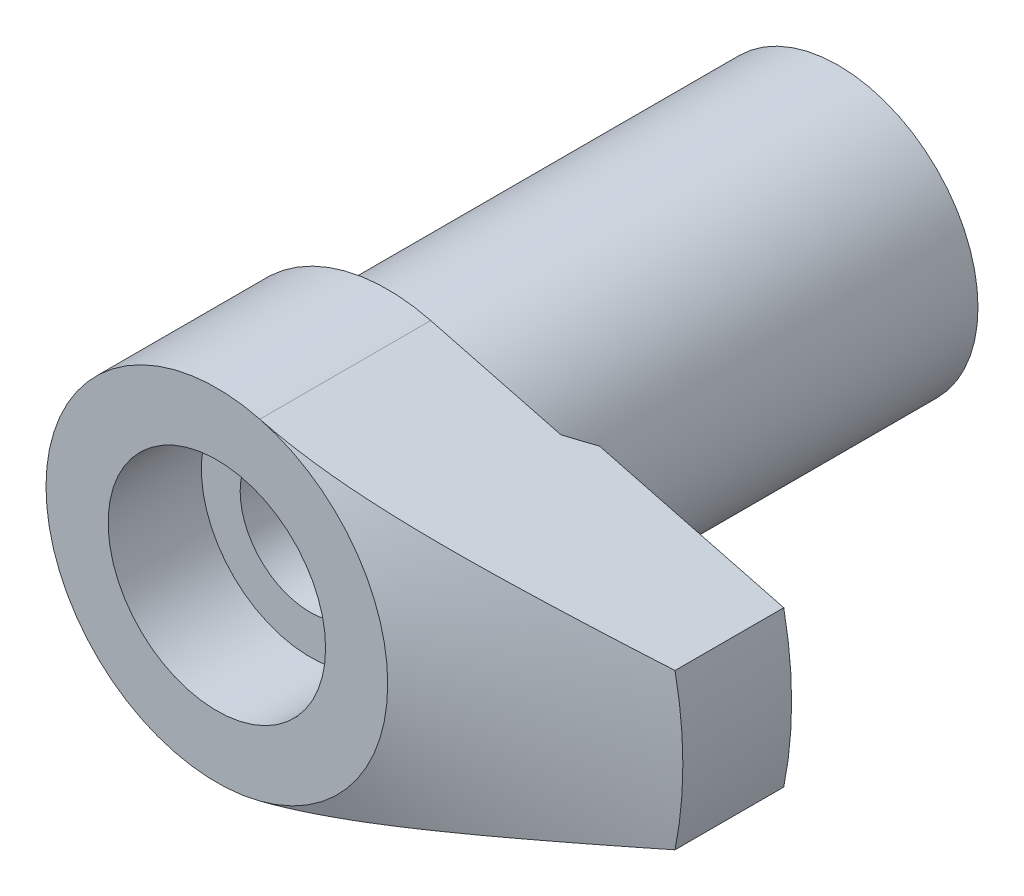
ISO-10303-21;
HEADER;
FILE_DESCRIPTION(('STEP AP214'),'2;1');
FILE_NAME('part.step','',(''),(''),'','','');
FILE_SCHEMA(('AUTOMOTIVE_DESIGN { 1 0 10303 214 1 1 1 1 }'));
ENDSEC;
DATA;
#1=APPLICATION_CONTEXT('core data for automotive mechanical design processes');
#2=APPLICATION_PROTOCOL_DEFINITION('international standard','automotive_design',2000,#1);
#3=PRODUCT_CONTEXT('',#1,'mechanical');
#4=PRODUCT('Part','Part','',(#3));
#5=PRODUCT_RELATED_PRODUCT_CATEGORY('part','',(#4));
#6=PRODUCT_DEFINITION_FORMATION('','',#4);
#7=PRODUCT_DEFINITION_CONTEXT('part definition',#1,'design');
#8=PRODUCT_DEFINITION('design','',#6,#7);
#9=PRODUCT_DEFINITION_SHAPE('','',#8);
#10=(LENGTH_UNIT() NAMED_UNIT(*) SI_UNIT(.MILLI.,.METRE.));
#11=(NAMED_UNIT(*) PLANE_ANGLE_UNIT() SI_UNIT($,.RADIAN.));
#12=(NAMED_UNIT(*) SI_UNIT($,.STERADIAN.) SOLID_ANGLE_UNIT());
#13=UNCERTAINTY_MEASURE_WITH_UNIT(LENGTH_MEASURE(1.E-05),#10,'distance_accuracy_value','');
#14=(GEOMETRIC_REPRESENTATION_CONTEXT(3) GLOBAL_UNCERTAINTY_ASSIGNED_CONTEXT((#13)) GLOBAL_UNIT_ASSIGNED_CONTEXT((#10,
#11,#12)) REPRESENTATION_CONTEXT('',''));
#15=CARTESIAN_POINT('',(0.,0.,0.));
#16=DIRECTION('',(0.,0.,1.));
#17=DIRECTION('',(1.,0.,0.));
#18=AXIS2_PLACEMENT_3D('',#15,#16,#17);
#19=CARTESIAN_POINT('',(24.4948974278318,5.,40.));
#20=DIRECTION('',(-0.25151064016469,-0.967854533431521,0.));
#21=DIRECTION('',(0.967854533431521,-0.25151064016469,0.));
#22=AXIS2_PLACEMENT_3D('',#19,#20,#21);
#23=PLANE('',#22);
#24=DIRECTION('',(0.967854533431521,-0.251510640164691,0.));
#25=VECTOR('',#24,1.);
#26=CARTESIAN_POINT('',(2.76661704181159,10.6463998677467,29.));
#27=LINE('',#26,#25);
#28=CARTESIAN_POINT('',(2.76661704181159,10.6463998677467,29.));
#29=VERTEX_POINT('',#28);
#30=CARTESIAN_POINT('',(11.1484831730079,8.46825383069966,29.));
#31=VERTEX_POINT('',#30);
#32=EDGE_CURVE('E76',#29,#31,#27,.T.);
#33=ORIENTED_EDGE('',*,*,#32,.F.);
#34=DIRECTION('',(0.,0.,-1.));
#35=VECTOR('',#34,1.);
#36=CARTESIAN_POINT('',(2.76661704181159,10.6463998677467,40.));
#37=LINE('',#36,#35);
#38=CARTESIAN_POINT('',(2.76661704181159,10.6463998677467,40.));
#39=VERTEX_POINT('',#38);
#40=EDGE_CURVE('E80',#39,#29,#37,.T.);
#41=ORIENTED_EDGE('',*,*,#40,.F.);
#42=CARTESIAN_POINT('',(24.4950974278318,4.99994802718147,34.9999337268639));
#43=CARTESIAN_POINT('',(24.0522116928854,5.11503812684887,35.1466796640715));
#44=CARTESIAN_POINT('',(23.6090863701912,5.23019048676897,35.2926581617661));
#45=CARTESIAN_POINT('',(22.7222658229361,5.46064330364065,35.5827713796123));
#46=CARTESIAN_POINT('',(22.2785705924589,5.57594376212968,35.7269060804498));
#47=CARTESIAN_POINT('',(21.3906147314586,5.80669160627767,36.0129920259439));
#48=CARTESIAN_POINT('',(20.9463542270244,5.92213895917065,36.1549436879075));
#49=CARTESIAN_POINT('',(20.0570760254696,6.15323043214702,36.4362914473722));
#50=CARTESIAN_POINT('',(19.6120583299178,6.26887455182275,36.5756875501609));
#51=CARTESIAN_POINT('',(18.7232977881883,6.49983150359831,36.8507651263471));
#52=CARTESIAN_POINT('',(18.2795592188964,6.6151432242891,36.9864613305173));
#53=CARTESIAN_POINT('',(17.3910601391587,6.84603223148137,37.2542320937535));
#54=CARTESIAN_POINT('',(16.94629963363,6.96160951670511,37.3863066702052));
#55=CARTESIAN_POINT('',(16.0554166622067,7.1931180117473,37.6461271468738));
#56=CARTESIAN_POINT('',(15.6092937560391,7.30904933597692,37.7738714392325));
#57=CARTESIAN_POINT('',(14.7156449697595,7.54127656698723,38.0240315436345));
#58=CARTESIAN_POINT('',(14.2681190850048,7.65757247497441,38.1464473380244));
#59=CARTESIAN_POINT('',(13.3686258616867,7.89131846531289,38.3855064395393));
#60=CARTESIAN_POINT('',(12.9166482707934,8.0087712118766,38.5021087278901));
#61=CARTESIAN_POINT('',(12.0107954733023,8.2441698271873,38.7271951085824));
#62=CARTESIAN_POINT('',(11.5569202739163,8.3621156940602,38.8356792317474));
#63=CARTESIAN_POINT('',(10.6474365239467,8.59845786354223,39.0425667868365));
#64=CARTESIAN_POINT('',(10.1918298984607,8.71685366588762,39.1409791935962));
#65=CARTESIAN_POINT('',(9.27826891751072,8.954255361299,39.3255960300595));
#66=CARTESIAN_POINT('',(8.82031448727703,9.07326127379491,39.4118000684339));
#67=CARTESIAN_POINT('',(7.8996808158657,9.31250090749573,39.5698254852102));
#68=CARTESIAN_POINT('',(7.43698939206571,9.43273779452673,39.641571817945));
#69=CARTESIAN_POINT('',(6.50937566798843,9.67379129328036,39.7673452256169));
#70=CARTESIAN_POINT('',(6.04445370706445,9.79460781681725,39.8213749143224));
#71=CARTESIAN_POINT('',(5.34500310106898,9.97636991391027,39.8872915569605));
#72=CARTESIAN_POINT('',(5.11113046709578,10.0371450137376,39.9067615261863));
#73=CARTESIAN_POINT('',(4.6430233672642,10.1587892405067,39.9403487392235));
#74=CARTESIAN_POINT('',(4.40878890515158,10.2196583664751,39.9544660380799));
#75=CARTESIAN_POINT('',(3.93993571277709,10.341496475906,39.9771441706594));
#76=CARTESIAN_POINT('',(3.70531684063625,10.4024654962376,39.9857018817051));
#77=CARTESIAN_POINT('',(3.23593856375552,10.5244400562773,39.997138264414));
#78=CARTESIAN_POINT('',(3.00117915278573,10.5854455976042,40.000016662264));
#79=CARTESIAN_POINT('',(2.7664170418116,10.6464518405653,39.9999999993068));
#80=B_SPLINE_CURVE_WITH_KNOTS('',3,(#42,#43,#44,#45,#46,#47,#48,#49,#50,#51,#52,#53,#54,#55,#56,
#57,#58,#59,#60,#61,#62,#63,#64,#65,#66,#67,#68,#69,#70,#71,#72,#73,#74,#75,#76,#77,#78,#79),
.UNSPECIFIED.,.F.,.F.,(4,2,2,2,2,2,2,2,2,2,2,2,2,2,2,2,2,2,4),(0.,1.44165002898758,
2.88331514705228,4.32470116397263,5.76608419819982,7.20048032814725,8.6348695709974,
10.0697857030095,11.5047065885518,12.9486269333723,14.3925417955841,15.8351585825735,
17.277821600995,18.7277903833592,20.1775451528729,20.9047655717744,21.631978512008,
22.3595995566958,23.0872556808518),.UNSPECIFIED.);
#81=CARTESIAN_POINT('',(24.4948974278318,5.,35.));
#82=VERTEX_POINT('',#81);
#83=EDGE_CURVE('E143',#82,#39,#80,.T.);
#84=ORIENTED_EDGE('',*,*,#83,.F.);
#85=DIRECTION('',(0.,0.,-1.));
#86=VECTOR('',#85,1.);
#87=CARTESIAN_POINT('',(24.4948974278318,5.,40.));
#88=LINE('',#87,#86);
#89=CARTESIAN_POINT('',(24.4948974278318,5.,28.));
#90=VERTEX_POINT('',#89);
#91=EDGE_CURVE('E99',#82,#90,#88,.T.);
#92=ORIENTED_EDGE('',*,*,#91,.T.);
#93=DIRECTION('',(-0.967854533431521,0.25151064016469,0.));
#94=VECTOR('',#93,1.);
#95=CARTESIAN_POINT('',(24.4948974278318,5.,28.));
#96=LINE('',#95,#94);
#97=CARTESIAN_POINT('',(12.6368353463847,8.0814845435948,28.));
#98=VERTEX_POINT('',#97);
#99=EDGE_CURVE('E198',#90,#98,#96,.T.);
#100=ORIENTED_EDGE('',*,*,#99,.T.);
#101=CARTESIAN_POINT('',(26.2382325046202,4.54696981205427,16.3706969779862));
#102=CARTESIAN_POINT('',(25.8991823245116,4.63507677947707,16.6897147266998));
#103=CARTESIAN_POINT('',(25.5595716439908,4.72332940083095,17.0080978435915));
#104=CARTESIAN_POINT('',(24.8790691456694,4.90016756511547,17.6434048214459));
#105=CARTESIAN_POINT('',(24.5381773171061,4.98875311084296,17.9603286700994));
#106=CARTESIAN_POINT('',(23.8548820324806,5.16631702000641,18.5925921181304));
#107=CARTESIAN_POINT('',(23.5124782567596,5.25529546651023,18.9079313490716));
#108=CARTESIAN_POINT('',(22.8260407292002,5.43367593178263,19.5367066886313));
#109=CARTESIAN_POINT('',(22.4820069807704,5.52307794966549,19.8501428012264));
#110=CARTESIAN_POINT('',(21.443461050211,5.79295874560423,20.790528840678));
#111=CARTESIAN_POINT('',(20.7461385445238,5.97416782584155,21.4141836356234));
#112=CARTESIAN_POINT('',(19.6928188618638,6.24788778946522,22.3406851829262));
#113=CARTESIAN_POINT('',(19.3405068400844,6.33944103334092,22.6480076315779));
#114=CARTESIAN_POINT('',(18.6330196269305,6.52329155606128,23.2591176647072));
#115=CARTESIAN_POINT('',(18.2778444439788,6.61558883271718,23.562905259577));
#116=CARTESIAN_POINT('',(17.6243853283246,6.78539939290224,24.1153607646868));
#117=CARTESIAN_POINT('',(17.3266162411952,6.86277888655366,24.3646784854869));
#118=CARTESIAN_POINT('',(16.7284511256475,7.01822052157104,24.859925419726));
#119=CARTESIAN_POINT('',(16.428055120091,7.09628265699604,25.1058546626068));
#120=CARTESIAN_POINT('',(15.8241820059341,7.25320759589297,25.5937959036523));
#121=CARTESIAN_POINT('',(15.5207042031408,7.3320705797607,25.8358069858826));
#122=CARTESIAN_POINT('',(14.910279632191,7.49069800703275,26.3151273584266));
#123=CARTESIAN_POINT('',(14.6033328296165,7.57046245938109,26.5524366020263));
#124=CARTESIAN_POINT('',(13.985611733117,7.73098599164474,27.0213074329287));
#125=CARTESIAN_POINT('',(13.6748396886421,7.81174448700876,27.2528721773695));
#126=CARTESIAN_POINT('',(13.0486773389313,7.97446159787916,27.709237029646));
#127=CARTESIAN_POINT('',(12.7332871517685,8.05642018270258,27.9340373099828));
#128=CARTESIAN_POINT('',(12.0972918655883,8.22169252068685,28.3753142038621));
#129=CARTESIAN_POINT('',(11.7766892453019,8.30500562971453,28.5917946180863));
#130=CARTESIAN_POINT('',(11.129246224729,8.47325282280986,29.0146878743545));
#131=CARTESIAN_POINT('',(10.8024050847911,8.55818709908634,29.2210995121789));
#132=CARTESIAN_POINT('',(10.117911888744,8.73606230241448,29.6357554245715));
#133=CARTESIAN_POINT('',(9.75972979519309,8.82914096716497,29.8430719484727));
#134=CARTESIAN_POINT('',(9.03406791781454,9.01771443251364,30.2394227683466));
#135=CARTESIAN_POINT('',(8.66659090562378,9.11320851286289,30.4284624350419));
#136=CARTESIAN_POINT('',(7.92165369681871,9.30679094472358,30.7831080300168));
#137=CARTESIAN_POINT('',(7.54420676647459,9.40487584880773,30.9487434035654));
#138=CARTESIAN_POINT('',(6.77840319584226,9.60388069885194,31.2506267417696));
#139=CARTESIAN_POINT('',(6.39005017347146,9.70479970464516,31.3868843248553));
#140=CARTESIAN_POINT('',(5.68950520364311,9.88684618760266,31.5970144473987));
#141=CARTESIAN_POINT('',(5.37932687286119,9.96745039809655,31.6780161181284));
#142=CARTESIAN_POINT('',(4.75371765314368,10.1300237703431,31.814494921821));
#143=CARTESIAN_POINT('',(4.43828751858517,10.2119927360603,31.8699756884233));
#144=CARTESIAN_POINT('',(3.8050254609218,10.376554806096,31.952547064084));
#145=CARTESIAN_POINT('',(3.48720563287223,10.4591447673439,31.9797352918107));
#146=CARTESIAN_POINT('',(2.85047359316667,10.6246085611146,32.0045695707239));
#147=CARTESIAN_POINT('',(2.53156140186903,10.7074823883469,32.0022161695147));
#148=CARTESIAN_POINT('',(1.89635384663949,10.8725500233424,31.9681621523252));
#149=CARTESIAN_POINT('',(1.58005322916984,10.9547451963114,31.9365643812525));
#150=CARTESIAN_POINT('',(0.951191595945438,11.118163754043,31.8458635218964));
#151=CARTESIAN_POINT('',(0.638630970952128,11.1993870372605,31.7867575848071));
#152=CARTESIAN_POINT('',(0.0158552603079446,11.3612240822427,31.6431401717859));
#153=CARTESIAN_POINT('',(-0.294306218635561,11.4418239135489,31.5583836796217));
#154=CARTESIAN_POINT('',(-0.90815448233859,11.6013410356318,31.3670987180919));
#155=CARTESIAN_POINT('',(-1.211842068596,11.6802585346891,31.2605729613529));
#156=CARTESIAN_POINT('',(-1.85174828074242,11.8465471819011,31.0140240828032));
#157=CARTESIAN_POINT('',(-2.18703716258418,11.9336767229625,30.8714433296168));
#158=CARTESIAN_POINT('',(-2.84944117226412,12.1058117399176,30.5671414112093));
#159=CARTESIAN_POINT('',(-3.17655313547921,12.1908163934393,30.4054129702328));
#160=CARTESIAN_POINT('',(-3.82402043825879,12.3590698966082,30.0660746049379));
#161=CARTESIAN_POINT('',(-4.14435525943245,12.4423134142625,29.8884231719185));
#162=CARTESIAN_POINT('',(-4.77813236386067,12.6070093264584,29.5206130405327));
#163=CARTESIAN_POINT('',(-5.09157553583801,12.6884619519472,29.3304559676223));
#164=CARTESIAN_POINT('',(-5.70078766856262,12.84677431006,28.9472912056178));
#165=CARTESIAN_POINT('',(-5.99677846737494,12.9236916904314,28.7546583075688));
#166=CARTESIAN_POINT('',(-6.58388700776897,13.0762601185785,28.3615982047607));
#167=CARTESIAN_POINT('',(-6.8750044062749,13.151911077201,28.1611704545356));
#168=CARTESIAN_POINT('',(-7.45101169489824,13.3015946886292,27.7552342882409));
#169=CARTESIAN_POINT('',(-7.73593036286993,13.3756348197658,27.5497693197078));
#170=CARTESIAN_POINT('',(-8.30199242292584,13.522734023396,27.1335064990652));
#171=CARTESIAN_POINT('',(-8.58313673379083,13.5957933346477,26.9227099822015));
#172=CARTESIAN_POINT('',(-8.86268598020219,13.6684381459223,26.7097144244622));
#173=B_SPLINE_CURVE_WITH_KNOTS('',3,(#101,#102,#103,#104,#105,#106,#107,#108,#109,#110,#111,
#112,#113,#114,#115,#116,#117,#118,#119,#120,#121,#122,#123,#124,#125,#126,#127,#128,#129,#130,
#131,#132,#133,#134,#135,#136,#137,#138,#139,#140,#141,#142,#143,#144,#145,#146,#147,#148,#149,
#150,#151,#152,#153,#154,#155,#156,#157,#158,#159,#160,#161,#162,#163,#164,#165,#166,#167,#168,
#169,#170,#171,#172),.UNSPECIFIED.,.F.,.F.,(4,2,2,2,2,2,2,2,2,2,2,2,2,2,2,2,2,2,2,2,2,2,2,2,2,2,
2,2,2,2,2,2,2,2,2,4),(0.,1.42141224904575,2.8428364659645,4.26457715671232,5.68631487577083,
8.54493189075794,9.9741023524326,11.4032686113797,12.5912386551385,13.7791983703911,
14.9674318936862,16.1556772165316,17.3432543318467,18.5308011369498,19.7177988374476,
20.9049381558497,22.1771102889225,23.448907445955,24.7190900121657,25.9888560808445,
26.9796391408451,27.9702810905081,28.9574935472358,29.9446877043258,30.9284232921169,
31.9122607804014,32.9058096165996,33.8992347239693,35.022369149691,36.1459317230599,
37.2725135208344,38.3989491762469,39.483111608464,40.5673500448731,41.6442669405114,
42.7209167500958),.UNSPECIFIED.);
#174=EDGE_CURVE('E83',#98,#31,#173,.T.);
#175=ORIENTED_EDGE('',*,*,#174,.T.);
#176=EDGE_LOOP('',(#33,#41,#84,#92,#100,#175));
#177=FACE_BOUND('',#176,.T.);
#178=ADVANCED_FACE('F15',(#177),#23,.F.);
#179=CARTESIAN_POINT('',(24.4948974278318,-5.,40.));
#180=DIRECTION('',(0.25151064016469,-0.967854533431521,0.));
#181=DIRECTION('',(0.967854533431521,0.25151064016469,0.));
#182=AXIS2_PLACEMENT_3D('',#179,#180,#181);
#183=PLANE('',#182);
#184=DIRECTION('',(0.,0.,-1.));
#185=VECTOR('',#184,1.);
#186=CARTESIAN_POINT('',(2.76661704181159,-10.6463998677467,40.));
#187=LINE('',#186,#185);
#188=CARTESIAN_POINT('',(2.76661704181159,-10.6463998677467,40.));
#189=VERTEX_POINT('',#188);
#190=CARTESIAN_POINT('',(2.76661704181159,-10.6463998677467,29.));
#191=VERTEX_POINT('',#190);
#192=EDGE_CURVE('E100',#189,#191,#187,.T.);
#193=ORIENTED_EDGE('',*,*,#192,.T.);
#194=DIRECTION('',(-0.967854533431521,-0.251510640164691,0.));
#195=VECTOR('',#194,1.);
#196=CARTESIAN_POINT('',(11.1484831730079,-8.46825383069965,29.));
#197=LINE('',#196,#195);
#198=CARTESIAN_POINT('',(11.1484831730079,-8.46825383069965,29.));
#199=VERTEX_POINT('',#198);
#200=EDGE_CURVE('E86',#199,#191,#197,.T.);
#201=ORIENTED_EDGE('',*,*,#200,.F.);
#202=CARTESIAN_POINT('',(26.2382325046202,-4.54696981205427,16.3706969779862));
#203=CARTESIAN_POINT('',(25.8991823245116,-4.63507677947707,16.6897147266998));
#204=CARTESIAN_POINT('',(25.5595716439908,-4.72332940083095,17.0080978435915));
#205=CARTESIAN_POINT('',(24.8790691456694,-4.90016756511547,17.6434048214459));
#206=CARTESIAN_POINT('',(24.5381773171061,-4.98875311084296,17.9603286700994));
#207=CARTESIAN_POINT('',(23.8548820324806,-5.16631702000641,18.5925921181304));
#208=CARTESIAN_POINT('',(23.5124782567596,-5.25529546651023,18.9079313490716));
#209=CARTESIAN_POINT('',(22.8260407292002,-5.43367593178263,19.5367066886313));
#210=CARTESIAN_POINT('',(22.4820069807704,-5.52307794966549,19.8501428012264));
#211=CARTESIAN_POINT('',(21.443461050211,-5.79295874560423,20.790528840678));
#212=CARTESIAN_POINT('',(20.7461385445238,-5.97416782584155,21.4141836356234));
#213=CARTESIAN_POINT('',(19.6928188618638,-6.24788778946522,22.3406851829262));
#214=CARTESIAN_POINT('',(19.3405068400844,-6.33944103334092,22.6480076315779));
#215=CARTESIAN_POINT('',(18.6330196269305,-6.52329155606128,23.2591176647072));
#216=CARTESIAN_POINT('',(18.2778444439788,-6.61558883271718,23.562905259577));
#217=CARTESIAN_POINT('',(17.6243853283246,-6.78539939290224,24.1153607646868));
#218=CARTESIAN_POINT('',(17.3266162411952,-6.86277888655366,24.3646784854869));
#219=CARTESIAN_POINT('',(16.7284511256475,-7.01822052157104,24.859925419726));
#220=CARTESIAN_POINT('',(16.428055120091,-7.09628265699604,25.1058546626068));
#221=CARTESIAN_POINT('',(15.8241820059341,-7.25320759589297,25.5937959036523));
#222=CARTESIAN_POINT('',(15.5207042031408,-7.3320705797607,25.8358069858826));
#223=CARTESIAN_POINT('',(14.910279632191,-7.49069800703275,26.3151273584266));
#224=CARTESIAN_POINT('',(14.6033328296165,-7.57046245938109,26.5524366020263));
#225=CARTESIAN_POINT('',(13.985611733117,-7.73098599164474,27.0213074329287));
#226=CARTESIAN_POINT('',(13.6748396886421,-7.81174448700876,27.2528721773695));
#227=CARTESIAN_POINT('',(13.0486773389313,-7.97446159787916,27.709237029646));
#228=CARTESIAN_POINT('',(12.7332871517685,-8.05642018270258,27.9340373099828));
#229=CARTESIAN_POINT('',(12.0972918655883,-8.22169252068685,28.3753142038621));
#230=CARTESIAN_POINT('',(11.7766892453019,-8.30500562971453,28.5917946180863));
#231=CARTESIAN_POINT('',(11.129246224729,-8.47325282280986,29.0146878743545));
#232=CARTESIAN_POINT('',(10.8024050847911,-8.55818709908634,29.2210995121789));
#233=CARTESIAN_POINT('',(10.117911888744,-8.73606230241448,29.6357554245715));
#234=CARTESIAN_POINT('',(9.75972979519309,-8.82914096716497,29.8430719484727));
#235=CARTESIAN_POINT('',(9.03406791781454,-9.01771443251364,30.2394227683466));
#236=CARTESIAN_POINT('',(8.66659090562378,-9.11320851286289,30.4284624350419));
#237=CARTESIAN_POINT('',(7.92165369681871,-9.30679094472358,30.7831080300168));
#238=CARTESIAN_POINT('',(7.54420676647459,-9.40487584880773,30.9487434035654));
#239=CARTESIAN_POINT('',(6.77840319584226,-9.60388069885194,31.2506267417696));
#240=CARTESIAN_POINT('',(6.39005017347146,-9.70479970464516,31.3868843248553));
#241=CARTESIAN_POINT('',(5.68950520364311,-9.88684618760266,31.5970144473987));
#242=CARTESIAN_POINT('',(5.37932687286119,-9.96745039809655,31.6780161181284));
#243=CARTESIAN_POINT('',(4.75371765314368,-10.1300237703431,31.814494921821));
#244=CARTESIAN_POINT('',(4.43828751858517,-10.2119927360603,31.8699756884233));
#245=CARTESIAN_POINT('',(3.8050254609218,-10.376554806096,31.952547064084));
#246=CARTESIAN_POINT('',(3.48720563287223,-10.4591447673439,31.9797352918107));
#247=CARTESIAN_POINT('',(2.85047359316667,-10.6246085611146,32.0045695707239));
#248=CARTESIAN_POINT('',(2.53156140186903,-10.7074823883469,32.0022161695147));
#249=CARTESIAN_POINT('',(1.89635384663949,-10.8725500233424,31.9681621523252));
#250=CARTESIAN_POINT('',(1.58005322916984,-10.9547451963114,31.9365643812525));
#251=CARTESIAN_POINT('',(0.951191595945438,-11.118163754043,31.8458635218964));
#252=CARTESIAN_POINT('',(0.638630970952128,-11.1993870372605,31.7867575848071));
#253=CARTESIAN_POINT('',(0.0158552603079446,-11.3612240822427,31.6431401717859));
#254=CARTESIAN_POINT('',(-0.294306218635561,-11.4418239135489,31.5583836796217));
#255=CARTESIAN_POINT('',(-0.90815448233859,-11.6013410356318,31.3670987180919));
#256=CARTESIAN_POINT('',(-1.211842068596,-11.6802585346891,31.2605729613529));
#257=CARTESIAN_POINT('',(-1.85174828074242,-11.8465471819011,31.0140240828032));
#258=CARTESIAN_POINT('',(-2.18703716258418,-11.9336767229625,30.8714433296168));
#259=CARTESIAN_POINT('',(-2.84944117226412,-12.1058117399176,30.5671414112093));
#260=CARTESIAN_POINT('',(-3.17655313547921,-12.1908163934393,30.4054129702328));
#261=CARTESIAN_POINT('',(-3.82402043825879,-12.3590698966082,30.0660746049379));
#262=CARTESIAN_POINT('',(-4.14435525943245,-12.4423134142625,29.8884231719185));
#263=CARTESIAN_POINT('',(-4.77813236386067,-12.6070093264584,29.5206130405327));
#264=CARTESIAN_POINT('',(-5.09157553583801,-12.6884619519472,29.3304559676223));
#265=CARTESIAN_POINT('',(-5.70078766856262,-12.84677431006,28.9472912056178));
#266=CARTESIAN_POINT('',(-5.99677846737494,-12.9236916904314,28.7546583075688));
#267=CARTESIAN_POINT('',(-6.58388700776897,-13.0762601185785,28.3615982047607));
#268=CARTESIAN_POINT('',(-6.8750044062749,-13.151911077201,28.1611704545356));
#269=CARTESIAN_POINT('',(-7.45101169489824,-13.3015946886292,27.7552342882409));
#270=CARTESIAN_POINT('',(-7.73593036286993,-13.3756348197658,27.5497693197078));
#271=CARTESIAN_POINT('',(-8.30199242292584,-13.522734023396,27.1335064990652));
#272=CARTESIAN_POINT('',(-8.58313673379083,-13.5957933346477,26.9227099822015));
#273=CARTESIAN_POINT('',(-8.86268598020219,-13.6684381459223,26.7097144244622));
#274=B_SPLINE_CURVE_WITH_KNOTS('',3,(#202,#203,#204,#205,#206,#207,#208,#209,#210,#211,#212,
#213,#214,#215,#216,#217,#218,#219,#220,#221,#222,#223,#224,#225,#226,#227,#228,#229,#230,#231,
#232,#233,#234,#235,#236,#237,#238,#239,#240,#241,#242,#243,#244,#245,#246,#247,#248,#249,#250,
#251,#252,#253,#254,#255,#256,#257,#258,#259,#260,#261,#262,#263,#264,#265,#266,#267,#268,#269,
#270,#271,#272,#273),.UNSPECIFIED.,.F.,.F.,(4,2,2,2,2,2,2,2,2,2,2,2,2,2,2,2,2,2,2,2,2,2,2,2,2,2,
2,2,2,2,2,2,2,2,2,4),(0.,1.42141224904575,2.8428364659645,4.26457715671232,5.68631487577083,
8.54493189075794,9.9741023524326,11.4032686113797,12.5912386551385,13.7791983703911,
14.9674318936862,16.1556772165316,17.3432543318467,18.5308011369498,19.7177988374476,
20.9049381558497,22.1771102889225,23.448907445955,24.7190900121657,25.9888560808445,
26.9796391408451,27.9702810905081,28.9574935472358,29.9446877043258,30.9284232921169,
31.9122607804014,32.9058096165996,33.8992347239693,35.022369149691,36.1459317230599,
37.2725135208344,38.3989491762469,39.483111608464,40.5673500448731,41.6442669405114,
42.7209167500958),.UNSPECIFIED.);
#275=CARTESIAN_POINT('',(12.6368353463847,-8.0814845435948,28.));
#276=VERTEX_POINT('',#275);
#277=EDGE_CURVE('E9',#276,#199,#274,.T.);
#278=ORIENTED_EDGE('',*,*,#277,.F.);
#279=DIRECTION('',(-0.967854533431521,-0.25151064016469,0.));
#280=VECTOR('',#279,1.);
#281=CARTESIAN_POINT('',(24.4948974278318,-5.,28.));
#282=LINE('',#281,#280);
#283=CARTESIAN_POINT('',(24.4948974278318,-5.,28.));
#284=VERTEX_POINT('',#283);
#285=EDGE_CURVE('E29',#284,#276,#282,.T.);
#286=ORIENTED_EDGE('',*,*,#285,.F.);
#287=DIRECTION('',(0.,0.,-1.));
#288=VECTOR('',#287,1.);
#289=CARTESIAN_POINT('',(24.4948974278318,-5.,40.));
#290=LINE('',#289,#288);
#291=CARTESIAN_POINT('',(24.4948974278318,-5.,35.));
#292=VERTEX_POINT('',#291);
#293=EDGE_CURVE('E43',#292,#284,#290,.T.);
#294=ORIENTED_EDGE('',*,*,#293,.F.);
#295=CARTESIAN_POINT('',(24.4950974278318,-4.99994802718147,34.9999337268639));
#296=CARTESIAN_POINT('',(24.0522116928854,-5.11503812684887,35.1466796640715));
#297=CARTESIAN_POINT('',(23.6090863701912,-5.23019048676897,35.2926581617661));
#298=CARTESIAN_POINT('',(22.7222658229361,-5.46064330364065,35.5827713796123));
#299=CARTESIAN_POINT('',(22.2785705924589,-5.57594376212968,35.7269060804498));
#300=CARTESIAN_POINT('',(21.3906147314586,-5.80669160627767,36.0129920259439));
#301=CARTESIAN_POINT('',(20.9463542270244,-5.92213895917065,36.1549436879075));
#302=CARTESIAN_POINT('',(20.0570760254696,-6.15323043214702,36.4362914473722));
#303=CARTESIAN_POINT('',(19.6120583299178,-6.26887455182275,36.5756875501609));
#304=CARTESIAN_POINT('',(18.7232977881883,-6.49983150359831,36.8507651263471));
#305=CARTESIAN_POINT('',(18.2795592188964,-6.6151432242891,36.9864613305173));
#306=CARTESIAN_POINT('',(17.3910601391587,-6.84603223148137,37.2542320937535));
#307=CARTESIAN_POINT('',(16.94629963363,-6.96160951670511,37.3863066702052));
#308=CARTESIAN_POINT('',(16.0554166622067,-7.1931180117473,37.6461271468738));
#309=CARTESIAN_POINT('',(15.6092937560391,-7.30904933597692,37.7738714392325));
#310=CARTESIAN_POINT('',(14.7156449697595,-7.54127656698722,38.0240315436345));
#311=CARTESIAN_POINT('',(14.2681190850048,-7.65757247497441,38.1464473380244));
#312=CARTESIAN_POINT('',(13.3686258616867,-7.89131846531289,38.3855064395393));
#313=CARTESIAN_POINT('',(12.9166482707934,-8.0087712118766,38.5021087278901));
#314=CARTESIAN_POINT('',(12.0107954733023,-8.2441698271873,38.7271951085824));
#315=CARTESIAN_POINT('',(11.5569202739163,-8.36211569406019,38.8356792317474));
#316=CARTESIAN_POINT('',(10.6474365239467,-8.59845786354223,39.0425667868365));
#317=CARTESIAN_POINT('',(10.1918298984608,-8.71685366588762,39.1409791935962));
#318=CARTESIAN_POINT('',(9.27826891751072,-8.95425536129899,39.3255960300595));
#319=CARTESIAN_POINT('',(8.82031448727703,-9.07326127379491,39.4118000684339));
#320=CARTESIAN_POINT('',(7.8996808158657,-9.31250090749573,39.5698254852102));
#321=CARTESIAN_POINT('',(7.43698939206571,-9.43273779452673,39.641571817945));
#322=CARTESIAN_POINT('',(6.50937566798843,-9.67379129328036,39.7673452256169));
#323=CARTESIAN_POINT('',(6.04445370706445,-9.79460781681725,39.8213749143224));
#324=CARTESIAN_POINT('',(5.34500310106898,-9.97636991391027,39.8872915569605));
#325=CARTESIAN_POINT('',(5.11113046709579,-10.0371450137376,39.9067615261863));
#326=CARTESIAN_POINT('',(4.6430233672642,-10.1587892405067,39.9403487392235));
#327=CARTESIAN_POINT('',(4.40878890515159,-10.2196583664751,39.9544660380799));
#328=CARTESIAN_POINT('',(3.9399357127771,-10.341496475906,39.9771441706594));
#329=CARTESIAN_POINT('',(3.70531684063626,-10.4024654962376,39.9857018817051));
#330=CARTESIAN_POINT('',(3.23593856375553,-10.5244400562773,39.997138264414));
#331=CARTESIAN_POINT('',(3.00117915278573,-10.5854455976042,40.000016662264));
#332=CARTESIAN_POINT('',(2.7664170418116,-10.6464518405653,39.9999999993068));
#333=B_SPLINE_CURVE_WITH_KNOTS('',3,(#295,#296,#297,#298,#299,#300,#301,#302,#303,#304,#305,
#306,#307,#308,#309,#310,#311,#312,#313,#314,#315,#316,#317,#318,#319,#320,#321,#322,#323,#324,
#325,#326,#327,#328,#329,#330,#331,#332),.UNSPECIFIED.,.F.,.F.,(4,2,2,2,2,2,2,2,2,2,2,2,2,2,2,2,
2,2,4),(0.,1.44165002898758,2.88331514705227,4.32470116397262,5.76608419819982,7.20048032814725,
8.6348695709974,10.0697857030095,11.5047065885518,12.9486269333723,14.3925417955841,
15.8351585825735,17.277821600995,18.7277903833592,20.1775451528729,20.9047655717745,
21.631978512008,22.3595995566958,23.0872556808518),.UNSPECIFIED.);
#334=EDGE_CURVE('E135',#292,#189,#333,.T.);
#335=ORIENTED_EDGE('',*,*,#334,.T.);
#336=EDGE_LOOP('',(#193,#201,#278,#286,#294,#335));
#337=FACE_BOUND('',#336,.T.);
#338=ADVANCED_FACE('F149',(#337),#183,.T.);
#339=CARTESIAN_POINT('',(0.,0.,40.));
#340=DIRECTION('',(0.,0.,-1.));
#341=DIRECTION('',(-1.,0.,0.));
#342=AXIS2_PLACEMENT_3D('',#339,#340,#341);
#343=CYLINDRICAL_SURFACE('',#342,11.);
#344=CARTESIAN_POINT('',(0.,0.,29.));
#345=DIRECTION('',(0.,0.,1.));
#346=DIRECTION('',(1.,0.,0.));
#347=AXIS2_PLACEMENT_3D('',#344,#345,#346);
#348=CIRCLE('',#347,11.);
#349=EDGE_CURVE('E89',#29,#191,#348,.T.);
#350=ORIENTED_EDGE('',*,*,#349,.T.);
#351=ORIENTED_EDGE('',*,*,#192,.F.);
#352=CARTESIAN_POINT('',(0.,0.,40.));
#353=DIRECTION('',(0.,0.,1.));
#354=DIRECTION('',(1.,0.,0.));
#355=AXIS2_PLACEMENT_3D('',#352,#353,#354);
#356=CIRCLE('',#355,11.);
#357=EDGE_CURVE('E98',#39,#189,#356,.T.);
#358=ORIENTED_EDGE('',*,*,#357,.F.);
#359=ORIENTED_EDGE('',*,*,#40,.T.);
#360=EDGE_LOOP('',(#350,#351,#358,#359));
#361=FACE_BOUND('',#360,.T.);
#362=ADVANCED_FACE('F97',(#361),#343,.T.);
#363=CARTESIAN_POINT('',(30.,20.,28.));
#364=DIRECTION('',(0.,0.,1.));
#365=DIRECTION('',(1.,0.,0.));
#366=AXIS2_PLACEMENT_3D('',#363,#364,#365);
#367=PLANE('',#366);
#368=ORIENTED_EDGE('',*,*,#285,.T.);
#369=CARTESIAN_POINT('',(0.,0.,28.));
#370=DIRECTION('',(0.,0.,1.));
#371=DIRECTION('',(1.,0.,0.));
#372=AXIS2_PLACEMENT_3D('',#369,#370,#371);
#373=CIRCLE('',#372,15.);
#374=EDGE_CURVE('E35',#276,#98,#373,.T.);
#375=ORIENTED_EDGE('',*,*,#374,.T.);
#376=ORIENTED_EDGE('',*,*,#99,.F.);
#377=CARTESIAN_POINT('',(0.,0.,28.));
#378=DIRECTION('',(0.,0.,1.));
#379=DIRECTION('',(1.,0.,0.));
#380=AXIS2_PLACEMENT_3D('',#377,#378,#379);
#381=CIRCLE('',#380,25.);
#382=EDGE_CURVE('E196',#284,#90,#381,.T.);
#383=ORIENTED_EDGE('',*,*,#382,.F.);
#384=EDGE_LOOP('',(#368,#375,#376,#383));
#385=FACE_BOUND('',#384,.T.);
#386=ADVANCED_FACE('F167',(#385),#367,.F.);
#387=CARTESIAN_POINT('',(0.,0.,0.));
#388=DIRECTION('',(0.,0.,-1.));
#389=DIRECTION('',(-1.,0.,0.));
#390=AXIS2_PLACEMENT_3D('',#387,#388,#389);
#391=CYLINDRICAL_SURFACE('',#390,4.5);
#392=CARTESIAN_POINT('',(0.,0.,24.));
#393=DIRECTION('',(0.,0.,-1.));
#394=DIRECTION('',(-1.,0.,0.));
#395=AXIS2_PLACEMENT_3D('',#392,#393,#394);
#396=CIRCLE('',#395,4.5);
#397=CARTESIAN_POINT('',(-4.5,0.,24.));
#398=VERTEX_POINT('',#397);
#399=EDGE_CURVE('E127',#398,#398,#396,.T.);
#400=ORIENTED_EDGE('',*,*,#399,.T.);
#401=EDGE_LOOP('',(#400));
#402=FACE_BOUND('',#401,.T.);
#403=CARTESIAN_POINT('',(0.,0.,34.));
#404=DIRECTION('',(0.,0.,1.));
#405=DIRECTION('',(1.,0.,0.));
#406=AXIS2_PLACEMENT_3D('',#403,#404,#405);
#407=CIRCLE('',#406,4.5);
#408=CARTESIAN_POINT('',(4.5,0.,34.));
#409=VERTEX_POINT('',#408);
#410=EDGE_CURVE('E107',#409,#409,#407,.T.);
#411=ORIENTED_EDGE('',*,*,#410,.T.);
#412=EDGE_LOOP('',(#411));
#413=FACE_BOUND('',#412,.T.);
#414=ADVANCED_FACE('F160',(#402,#413),#391,.F.);
#415=CARTESIAN_POINT('',(0.,0.,0.));
#416=DIRECTION('',(0.,0.,1.));
#417=DIRECTION('',(1.,0.,0.));
#418=AXIS2_PLACEMENT_3D('',#415,#416,#417);
#419=PLANE('',#418);
#420=CARTESIAN_POINT('',(0.,0.,0.));
#421=DIRECTION('',(0.,0.,-1.));
#422=DIRECTION('',(-1.,0.,0.));
#423=AXIS2_PLACEMENT_3D('',#420,#421,#422);
#424=CIRCLE('',#423,9.);
#425=CARTESIAN_POINT('',(-9.,0.,0.));
#426=VERTEX_POINT('',#425);
#427=EDGE_CURVE('E199',#426,#426,#424,.T.);
#428=ORIENTED_EDGE('',*,*,#427,.T.);
#429=EDGE_LOOP('',(#428));
#430=FACE_BOUND('',#429,.T.);
#431=CARTESIAN_POINT('',(0.,0.,0.));
#432=DIRECTION('',(0.,0.,-1.));
#433=DIRECTION('',(-1.,0.,0.));
#434=AXIS2_PLACEMENT_3D('',#431,#432,#433);
#435=CIRCLE('',#434,7.);
#436=CARTESIAN_POINT('',(-7.,0.,0.));
#437=VERTEX_POINT('',#436);
#438=EDGE_CURVE('E109',#437,#437,#435,.T.);
#439=ORIENTED_EDGE('',*,*,#438,.F.);
#440=EDGE_LOOP('',(#439));
#441=FACE_BOUND('',#440,.T.);
#442=ADVANCED_FACE('F171',(#430,#441),#419,.F.);
#443=CARTESIAN_POINT('',(0.,0.,40.));
#444=DIRECTION('',(0.,0.,1.));
#445=DIRECTION('',(1.,0.,0.));
#446=AXIS2_PLACEMENT_3D('',#443,#444,#445);
#447=PLANE('',#446);
#448=CARTESIAN_POINT('',(0.,0.,40.));
#449=DIRECTION('',(0.,0.,1.));
#450=DIRECTION('',(1.,0.,0.));
#451=AXIS2_PLACEMENT_3D('',#448,#449,#450);
#452=CIRCLE('',#451,7.);
#453=CARTESIAN_POINT('',(7.,0.,40.));
#454=VERTEX_POINT('',#453);
#455=EDGE_CURVE('E117',#454,#454,#452,.T.);
#456=ORIENTED_EDGE('',*,*,#455,.F.);
#457=EDGE_LOOP('',(#456));
#458=FACE_BOUND('',#457,.T.);
#459=ORIENTED_EDGE('',*,*,#357,.T.);
#460=CARTESIAN_POINT('',(0.,0.,40.));
#461=DIRECTION('',(0.,0.,1.));
#462=DIRECTION('',(1.,0.,0.));
#463=AXIS2_PLACEMENT_3D('',#460,#461,#462);
#464=CIRCLE('',#463,11.);
#465=EDGE_CURVE('E130',#189,#39,#464,.T.);
#466=ORIENTED_EDGE('',*,*,#465,.T.);
#467=EDGE_LOOP('',(#459,#466));
#468=FACE_BOUND('',#467,.T.);
#469=ADVANCED_FACE('F174',(#458,#468),#447,.T.);
#470=CARTESIAN_POINT('',(0.,0.,40.));
#471=DIRECTION('',(0.,0.,-1.));
#472=DIRECTION('',(-1.,0.,0.));
#473=AXIS2_PLACEMENT_3D('',#470,#471,#472);
#474=CYLINDRICAL_SURFACE('',#473,25.);
#475=CARTESIAN_POINT('',(0.,0.,35.));
#476=DIRECTION('',(0.,0.,1.));
#477=DIRECTION('',(1.,0.,0.));
#478=AXIS2_PLACEMENT_3D('',#475,#476,#477);
#479=CIRCLE('',#478,25.);
#480=EDGE_CURVE('E133',#292,#82,#479,.T.);
#481=ORIENTED_EDGE('',*,*,#480,.F.);
#482=ORIENTED_EDGE('',*,*,#293,.T.);
#483=ORIENTED_EDGE('',*,*,#382,.T.);
#484=ORIENTED_EDGE('',*,*,#91,.F.);
#485=EDGE_LOOP('',(#481,#482,#483,#484));
#486=FACE_BOUND('',#485,.T.);
#487=ADVANCED_FACE('F165',(#486),#474,.T.);
#488=CARTESIAN_POINT('',(0.,0.,28.));
#489=DIRECTION('',(0.,0.,-1.));
#490=DIRECTION('',(-1.,0.,0.));
#491=AXIS2_PLACEMENT_3D('',#488,#489,#490);
#492=CYLINDRICAL_SURFACE('',#491,9.);
#493=ORIENTED_EDGE('',*,*,#427,.F.);
#494=EDGE_LOOP('',(#493));
#495=FACE_BOUND('',#494,.T.);
#496=CARTESIAN_POINT('',(0.,0.,29.));
#497=DIRECTION('',(0.,0.,1.));
#498=DIRECTION('',(1.,0.,0.));
#499=AXIS2_PLACEMENT_3D('',#496,#497,#498);
#500=CIRCLE('',#499,9.);
#501=CARTESIAN_POINT('',(9.,0.,29.));
#502=VERTEX_POINT('',#501);
#503=EDGE_CURVE('E95',#502,#502,#500,.T.);
#504=ORIENTED_EDGE('',*,*,#503,.F.);
#505=EDGE_LOOP('',(#504));
#506=FACE_BOUND('',#505,.T.);
#507=ADVANCED_FACE('F158',(#495,#506),#492,.T.);
#508=CARTESIAN_POINT('',(0.,0.,40.));
#509=DIRECTION('',(0.,0.,-1.));
#510=DIRECTION('',(-1.,0.,0.));
#511=AXIS2_PLACEMENT_3D('',#508,#509,#510);
#512=CONICAL_SURFACE('',#511,11.,1.22777238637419);
#513=ORIENTED_EDGE('',*,*,#83,.T.);
#514=ORIENTED_EDGE('',*,*,#465,.F.);
#515=ORIENTED_EDGE('',*,*,#334,.F.);
#516=ORIENTED_EDGE('',*,*,#480,.T.);
#517=EDGE_LOOP('',(#513,#514,#515,#516));
#518=FACE_BOUND('',#517,.T.);
#519=ADVANCED_FACE('F152',(#518),#512,.T.);
#520=CARTESIAN_POINT('',(4.5,0.,24.));
#521=DIRECTION('',(0.,0.,-1.));
#522=DIRECTION('',(-1.,0.,0.));
#523=AXIS2_PLACEMENT_3D('',#520,#521,#522);
#524=PLANE('',#523);
#525=CARTESIAN_POINT('',(0.,0.,24.));
#526=DIRECTION('',(0.,0.,-1.));
#527=DIRECTION('',(-1.,0.,0.));
#528=AXIS2_PLACEMENT_3D('',#525,#526,#527);
#529=CIRCLE('',#528,7.);
#530=CARTESIAN_POINT('',(-7.,0.,24.));
#531=VERTEX_POINT('',#530);
#532=EDGE_CURVE('E114',#531,#531,#529,.T.);
#533=ORIENTED_EDGE('',*,*,#532,.T.);
#534=EDGE_LOOP('',(#533));
#535=FACE_BOUND('',#534,.T.);
#536=ORIENTED_EDGE('',*,*,#399,.F.);
#537=EDGE_LOOP('',(#536));
#538=FACE_BOUND('',#537,.T.);
#539=ADVANCED_FACE('F157',(#535,#538),#524,.T.);
#540=CARTESIAN_POINT('',(0.,0.,0.));
#541=DIRECTION('',(0.,0.,-1.));
#542=DIRECTION('',(-1.,0.,0.));
#543=AXIS2_PLACEMENT_3D('',#540,#541,#542);
#544=CYLINDRICAL_SURFACE('',#543,7.);
#545=ORIENTED_EDGE('',*,*,#438,.T.);
#546=EDGE_LOOP('',(#545));
#547=FACE_BOUND('',#546,.T.);
#548=ORIENTED_EDGE('',*,*,#532,.F.);
#549=EDGE_LOOP('',(#548));
#550=FACE_BOUND('',#549,.T.);
#551=ADVANCED_FACE('F231',(#547,#550),#544,.F.);
#552=CARTESIAN_POINT('',(0.,0.,34.));
#553=DIRECTION('',(0.,0.,1.));
#554=DIRECTION('',(1.,0.,0.));
#555=AXIS2_PLACEMENT_3D('',#552,#553,#554);
#556=CYLINDRICAL_SURFACE('',#555,7.);
#557=CARTESIAN_POINT('',(0.,0.,34.));
#558=DIRECTION('',(0.,0.,1.));
#559=DIRECTION('',(1.,0.,0.));
#560=AXIS2_PLACEMENT_3D('',#557,#558,#559);
#561=CIRCLE('',#560,7.);
#562=CARTESIAN_POINT('',(7.,0.,34.));
#563=VERTEX_POINT('',#562);
#564=EDGE_CURVE('E110',#563,#563,#561,.T.);
#565=ORIENTED_EDGE('',*,*,#564,.F.);
#566=EDGE_LOOP('',(#565));
#567=FACE_BOUND('',#566,.T.);
#568=ORIENTED_EDGE('',*,*,#455,.T.);
#569=EDGE_LOOP('',(#568));
#570=FACE_BOUND('',#569,.T.);
#571=ADVANCED_FACE('F227',(#567,#570),#556,.F.);
#572=CARTESIAN_POINT('',(0.,0.,34.));
#573=DIRECTION('',(0.,0.,1.));
#574=DIRECTION('',(1.,0.,0.));
#575=AXIS2_PLACEMENT_3D('',#572,#573,#574);
#576=PLANE('',#575);
#577=ORIENTED_EDGE('',*,*,#410,.F.);
#578=EDGE_LOOP('',(#577));
#579=FACE_BOUND('',#578,.T.);
#580=ORIENTED_EDGE('',*,*,#564,.T.);
#581=EDGE_LOOP('',(#580));
#582=FACE_BOUND('',#581,.T.);
#583=ADVANCED_FACE('F226',(#579,#582),#576,.T.);
#584=CARTESIAN_POINT('',(-9.,0.,29.));
#585=DIRECTION('',(0.,0.,-1.));
#586=DIRECTION('',(-1.,0.,0.));
#587=AXIS2_PLACEMENT_3D('',#584,#585,#586);
#588=PLANE('',#587);
#589=ORIENTED_EDGE('',*,*,#503,.T.);
#590=EDGE_LOOP('',(#589));
#591=FACE_BOUND('',#590,.T.);
#592=ORIENTED_EDGE('',*,*,#349,.F.);
#593=ORIENTED_EDGE('',*,*,#32,.T.);
#594=CARTESIAN_POINT('',(0.,0.,29.));
#595=DIRECTION('',(0.,0.,1.));
#596=DIRECTION('',(1.,0.,0.));
#597=AXIS2_PLACEMENT_3D('',#594,#595,#596);
#598=CIRCLE('',#597,14.);
#599=EDGE_CURVE('E217',#199,#31,#598,.T.);
#600=ORIENTED_EDGE('',*,*,#599,.F.);
#601=ORIENTED_EDGE('',*,*,#200,.T.);
#602=EDGE_LOOP('',(#592,#593,#600,#601));
#603=FACE_BOUND('',#602,.T.);
#604=ADVANCED_FACE('F90',(#591,#603),#588,.T.);
#605=CARTESIAN_POINT('',(0.,0.,29.));
#606=DIRECTION('',(0.,0.,-1.));
#607=DIRECTION('',(-1.,0.,0.));
#608=AXIS2_PLACEMENT_3D('',#605,#606,#607);
#609=CONICAL_SURFACE('',#608,14.,0.785398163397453);
#610=ORIENTED_EDGE('',*,*,#374,.F.);
#611=ORIENTED_EDGE('',*,*,#277,.T.);
#612=ORIENTED_EDGE('',*,*,#599,.T.);
#613=ORIENTED_EDGE('',*,*,#174,.F.);
#614=EDGE_LOOP('',(#610,#611,#612,#613));
#615=FACE_BOUND('',#614,.T.);
#616=ADVANCED_FACE('F219',(#615),#609,.F.);
#617=CLOSED_SHELL('',(#178,#338,#362,#386,#414,#442,#469,#487,#507,#519,#539,#551,#571,#583,
#604,#616));
#618=MANIFOLD_SOLID_BREP('B1',#617);
#619=ADVANCED_BREP_SHAPE_REPRESENTATION('',(#18,#618),#14);
#620=SHAPE_DEFINITION_REPRESENTATION(#9,#619);
ENDSEC;
END-ISO-10303-21;
